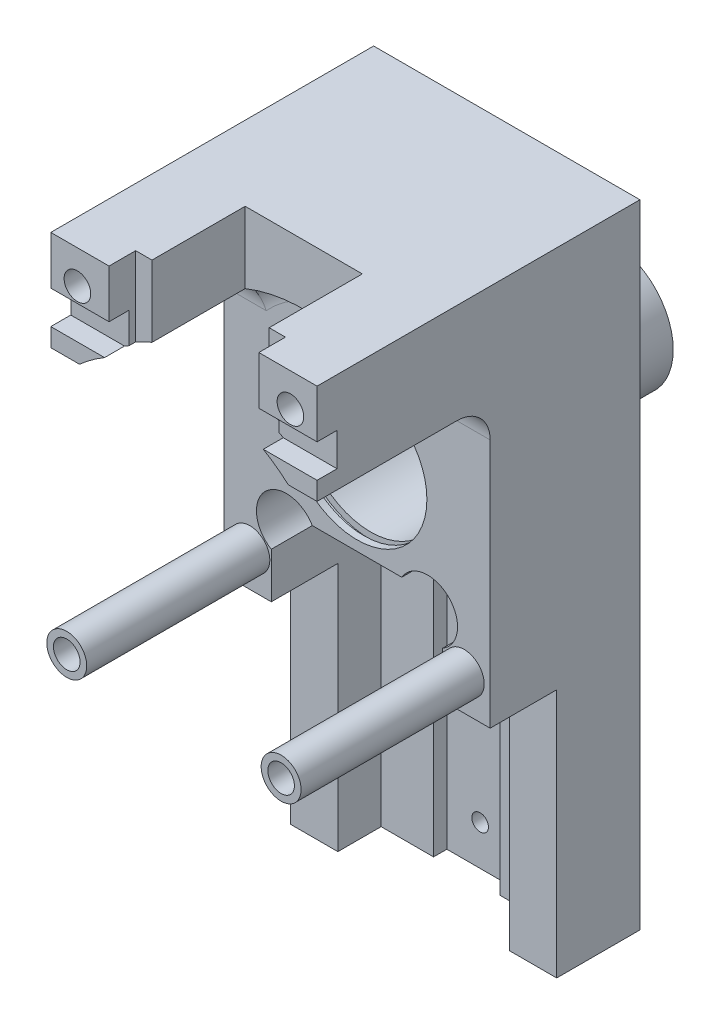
from build123d import *

# Parameters (mm, degrees)
LINEAR_AUSTRAGEN1_DEPTH             = 40
SKIZZE2_R                           = 19
LINEAR_AUSTRAGEN2_DEPTH             = 31
SCHNITT_LINEAR_AUSTRAGEN1_REACH     = 180.298
SKIZZE3_R                           = 11.5
SKIZZE4_R                           = 21
SCHNITT_LINEAR_AUSTRAGEN2_DEPTH     = 34
SKIZZE5_R                           = 18
SCHNITT_LINEAR_AUSTRAGEN3_DEPTH     = 4
SKIZZE7_W                           = 2
SKIZZE7_H                           = 2
SKIZZE9_R                           = 47
SCHNITT_LINEAR_AUSTRAGEN4_DEPTH     = 52
SKIZZE12_W                          = 35.2
SKIZZE12_H                          = 25
SCHNITT_LINEAR_AUSTRAGEN5_DEPTH     = 36
VERRUNDUNG1_R                       = 10
M8X1_25_GEWINDEBOHRUNG1_D           = 6.8
M8X1_25_GEWINDEBOHRUNG1_DEPTH       = 22.25
M8X1_25_GEWINDEBOHRUNG1_CBORE_D     = 8
M8X1_25_GEWINDEBOHRUNG1_CBORE_DEPTH = 16
M8X1_25_GEWINDEBOHRUNG1_TIP         = 2.042926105
SKIZZE15_R                          = 6
LINEAR_AUSTRAGEN3_DEPTH             = 55
M8X1_25_GEWINDEBOHRUNG2_D           = 6.8
M8X1_25_GEWINDEBOHRUNG2_DEPTH       = 22.25
M8X1_25_GEWINDEBOHRUNG2_CBORE_D     = 8
M8X1_25_GEWINDEBOHRUNG2_CBORE_DEPTH = 16
M8X1_25_GEWINDEBOHRUNG2_TIP         = 2.042926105
SKIZZE18_W                          = 45
SKIZZE18_H                          = 30
SCHNITT_LINEAR_AUSTRAGEN6_DEPTH     = 8
SCHNITT_LINEAR_AUSTRAGEN7_DEPTH     = 33
SCHNITT_LINEAR_AUSTRAGEN8_DEPTH     = 4
M5X0_8_GEWINDEBOHRUNG1_D            = 5


with BuildPart() as part:
    # Skizze1 → Linear austragen1 (new, symmetric)
    with BuildSketch(Plane(origin=(0, 0, 0), x_dir=(0, 0, -1), z_dir=(1, 0, 0))):
        Polygon((-52, 72.5), (45, 72.5), (45, -117.5), (20, -117.5), (20, -42.5), (0, -42.5), (0, 42.5), (-52, 42.5), (-52, 48), (-46, 48), (-46, 58), (-52, 58), align=None)
    extrude(amount=LINEAR_AUSTRAGEN1_DEPTH, both=True)

    # Skizze2 → Linear austragen2 (add)
    with BuildSketch(Plane(origin=(0, 0, -45), x_dir=(-1, 0, 0), z_dir=(0, 0, -1))):
        with Locations(Location((0, 7.5, 0), (0, 0, 270))):
            Circle(SKIZZE2_R)
    extrude(amount=LINEAR_AUSTRAGEN2_DEPTH)

    # Skizze3 → Schnitt-Linear austragen1 (cut, up to next)
    with BuildSketch(Plane(origin=(0, 0, -76), x_dir=(-1, 0, 0), z_dir=(0, 0, -1)), mode=Mode.PRIVATE) as schnitt_linear_austragen1_sk1:
        with Locations(Location((0, 7.5, 0), (0, 0, 90))):
            Circle(SKIZZE3_R)
    schnitt_linear_austragen1_tool1 = extrude(schnitt_linear_austragen1_sk1.sketch, amount=-SCHNITT_LINEAR_AUSTRAGEN1_REACH, mode=Mode.PRIVATE) & part.part
    add(schnitt_linear_austragen1_tool1.solids().sort_by_distance((0, 7.5, -76))[0], mode=Mode.SUBTRACT)

    # Skizze4 → Schnitt-Linear austragen2 (cut)
    with BuildSketch(Plane.XY):
        with Locations((0, 7.5)):
            Circle(SKIZZE4_R)
    extrude(amount=-SCHNITT_LINEAR_AUSTRAGEN2_DEPTH, mode=Mode.SUBTRACT)

    # Skizze5 → Schnitt-Linear austragen3 (cut)
    with BuildSketch(Plane.XY.offset(-34)):
        with Locations((0, 7.5)):
            Circle(SKIZZE5_R)
    extrude(amount=-SCHNITT_LINEAR_AUSTRAGEN3_DEPTH, mode=Mode.SUBTRACT)

    # Schnitt-Austragung1: sweep along a path in Skizze8
    with BuildLine(Plane.XY.offset(-4)) as schnitt_austragung1_path:
        CenterArc((0, 7.5), 17.598366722, 0, 360)
    # Skizze7 → Schnitt-Austragung1 (sweep, cut)
    with BuildSketch(Plane.XZ.offset(-7.5)):
        with Locations((22, -3.1)):
            Rectangle(SKIZZE7_W, SKIZZE7_H)
    sweep(path=schnitt_austragung1_path.line, mode=Mode.SUBTRACT)

    # Skizze9 → Schnitt-Linear austragen4 (cut)
    with BuildSketch(Plane.XY.offset(52)):
        with Locations((0, 7.5)):
            Circle(SKIZZE9_R)
    extrude(amount=-SCHNITT_LINEAR_AUSTRAGEN4_DEPTH, mode=Mode.SUBTRACT)

    # Skizze12 → Schnitt-Linear austragen5 (cut)
    with BuildSketch(Plane.XY.offset(52)):
        with Locations((0, 60)):
            Rectangle(SKIZZE12_W, SKIZZE12_H)
    extrude(amount=-SCHNITT_LINEAR_AUSTRAGEN5_DEPTH, mode=Mode.SUBTRACT)

    # Verrundung1
    verrundung1_edges = [part.edges().sort_by_distance(p)[0] for p in [
        (35.684387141, 42.5, 0),
        (-35.684387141, 42.5, 0),
        (0, 54.5, 0),
    ]]
    fillet(verrundung1_edges, radius=VERRUNDUNG1_R)

    # M8x1.25 Gewindebohrung1
    with Locations(Plane.XY.offset(52)):
        with Locations((32, 62.5), (-32, 62.5)):
            CounterBoreHole(M8X1_25_GEWINDEBOHRUNG1_D / 2, M8X1_25_GEWINDEBOHRUNG1_CBORE_D / 2, M8X1_25_GEWINDEBOHRUNG1_CBORE_DEPTH, depth=M8X1_25_GEWINDEBOHRUNG1_DEPTH)
            with Locations((0, 0, -(M8X1_25_GEWINDEBOHRUNG1_DEPTH + M8X1_25_GEWINDEBOHRUNG1_TIP / 2))):  # 118° drill point
                Cone(0, M8X1_25_GEWINDEBOHRUNG1_D / 2, M8X1_25_GEWINDEBOHRUNG1_TIP, mode=Mode.SUBTRACT)

    # Skizze15 → Linear austragen3 (add)
    with BuildSketch(Plane.XY):
        with Locations(Location((-32.2, -31.9, 0), (0, 0, 180))):
            Circle(SKIZZE15_R)
        with Locations(Location((32.2, -31.9, 0), (0, 0, 180))):
            Circle(SKIZZE15_R)
    extrude(amount=LINEAR_AUSTRAGEN3_DEPTH)

    # M8x1.25 Gewindebohrung2
    with Locations(Plane.XY.offset(55)):
        with Locations((32.2, -31.9), (-32.2, -31.9)):
            CounterBoreHole(M8X1_25_GEWINDEBOHRUNG2_D / 2, M8X1_25_GEWINDEBOHRUNG2_CBORE_D / 2, M8X1_25_GEWINDEBOHRUNG2_CBORE_DEPTH, depth=M8X1_25_GEWINDEBOHRUNG2_DEPTH)
            with Locations((0, 0, -(M8X1_25_GEWINDEBOHRUNG2_DEPTH + M8X1_25_GEWINDEBOHRUNG2_TIP / 2))):  # 118° drill point
                Cone(0, M8X1_25_GEWINDEBOHRUNG2_D / 2, M8X1_25_GEWINDEBOHRUNG2_TIP, mode=Mode.SUBTRACT)

    # Skizze18 → Schnitt-Linear austragen6 (cut)
    with BuildSketch(Plane.XY.offset(52)):
        with Locations((0, 57.5)):
            Rectangle(SKIZZE18_W, SKIZZE18_H)
    extrude(amount=-SCHNITT_LINEAR_AUSTRAGEN6_DEPTH, mode=Mode.SUBTRACT)

    # Skizze19 → Schnitt-Linear austragen7 (cut)
    with BuildSketch(Plane.XY):
        with BuildLine():
            Line((-13.440335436, -16.5), (13.440335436, -16.5))
            ThreePointArc((13.440335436, -16.5), (27.577164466, -14.672835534), (25.75, -28.809664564))
            Line((25.75, -28.809664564), (25.75, -117.5))
            Line((25.75, -117.5), (-25.75, -117.5))
            Line((-25.75, -117.5), (-25.75, -28.809664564))
            ThreePointArc((-25.75, -28.809664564), (-27.577164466, -14.672835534), (-13.440335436, -16.5))
        make_face()
    extrude(amount=-SCHNITT_LINEAR_AUSTRAGEN7_DEPTH, mode=Mode.SUBTRACT)

    # Skizze20 → Schnitt-Linear austragen8 (cut)
    with BuildSketch(Plane.XY.offset(-33)):
        with BuildLine():
            Line((-10, -117.5), (10, -117.5))
            Line((10, -117.5), (10, -34.5))
            ThreePointArc((10, -34.5), (19, -25.5), (10, -16.5))
            Line((10, -16.5), (-10, -16.5))
            ThreePointArc((-10, -16.5), (-19, -25.5), (-10, -34.5))
            Line((-10, -34.5), (-10, -117.5))
        make_face()
    extrude(amount=-SCHNITT_LINEAR_AUSTRAGEN8_DEPTH, mode=Mode.SUBTRACT)

    # M5x0.8 Gewindebohrung1 (through all)
    with Locations(Plane.XY.offset(-37)):
        with Locations((0, -105.5), (0, -45.5)):
            Hole(M5X0_8_GEWINDEBOHRUNG1_D / 2)


solid = part.part
